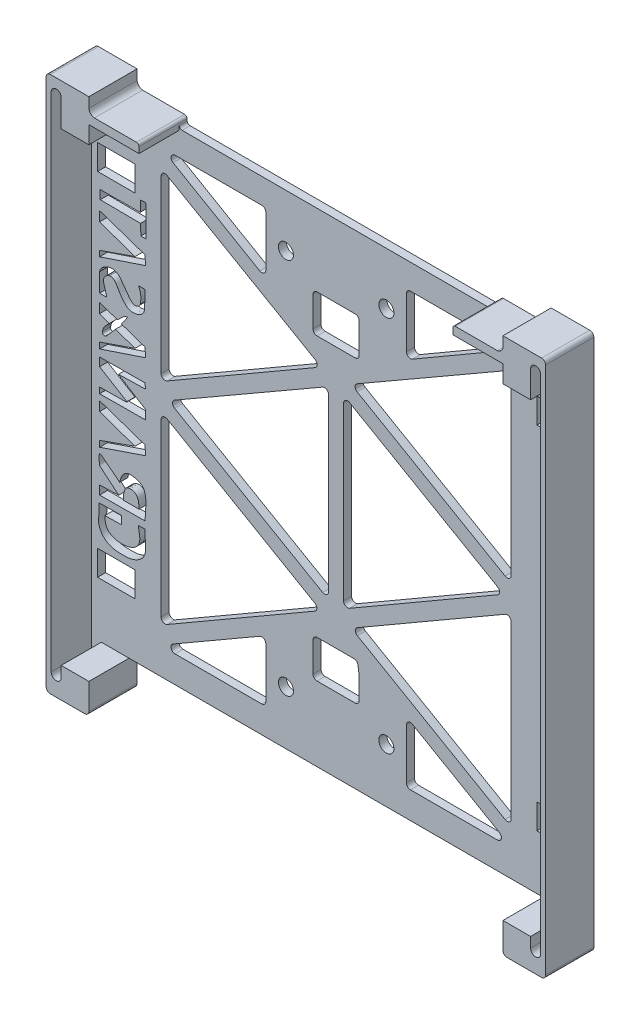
from build123d import *

# Parameters (mm, degrees)
MODEL_W                  = 7.5012
MODEL_H                  = 5.0008
MODEL_R                  = 1.504027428
MODEL_R_2                = 1.502934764
MODEL_R_3                = 1.508781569
MODEL_R_4                = 1.499795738
BOSS_EXTRUDE1_DEPTH      = 1.6
BOSS_EXTRUDE3_DEPTH      = 8
BOSS_EXTRUDE3_DEPTH_BACK = 1.6
CUT_EXTRUDE3_DEPTH       = 1.6


with BuildPart() as part:
    # Model → Boss-Extrude1 (new body)
    with BuildSketch(Plane.XY):
        with BuildLine():
            Line((32.018808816, 162.884149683), (22.042980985, 162.884149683))
            Line((22.042980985, 162.884149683), (22.042980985, 159.412149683))
            Line((22.042980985, 159.412149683), (16.534180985, 159.412149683))
            Line((16.534180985, 159.412149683), (16.534180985, 164.832149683))
            ThreePointArc((16.534180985, 164.832149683), (15.534180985, 165.784563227), (14.534180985, 164.832149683))
            Line((14.534180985, 164.832149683), (14.534180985, 64.720646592))
            ThreePointArc((14.534180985, 64.720646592), (15.608703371, 63.748696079), (16.528746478, 64.867984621))
            Line((16.528746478, 64.867984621), (16.528746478, 66.871184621))
            Line((16.528746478, 66.871184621), (110.000931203, 66.871184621))
            Line((110.000931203, 66.871184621), (110.000931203, 64.867984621))
            ThreePointArc((110.000931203, 64.867984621), (110.927950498, 63.843135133), (111.995496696, 64.720646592))
            Line((111.995496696, 64.720646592), (111.995496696, 164.877016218))
            ThreePointArc((111.995496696, 164.877016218), (110.976206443, 165.784310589), (109.998696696, 164.832149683))
            Line((109.998696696, 164.832149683), (109.998696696, 159.412149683))
            Line((109.998696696, 159.412149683), (104.486696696, 159.412149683))
            Line((104.486696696, 159.412149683), (104.486696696, 162.884149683))
            Line((104.486696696, 162.884149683), (94.510868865, 162.884149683))
            Line((94.510868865, 162.884149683), (94.510868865, 163.684149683))
            ThreePointArc((94.510868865, 163.684149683), (94.364422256, 163.330596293), (94.010868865, 163.184149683))
            Line((94.010868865, 163.184149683), (32.605896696, 163.184149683))
            ThreePointArc((32.605896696, 163.184149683), (32.220321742, 163.326089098), (32.018808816, 163.684149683))
            Line((32.018808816, 163.684149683), (32.018808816, 162.884149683))
        make_face()
        with BuildLine():
            Line((30.788836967, 73.688085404), (48.076150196, 83.6737952))
            ThreePointArc((48.076150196, 83.6737952), (48.876223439, 83.673922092), (49.276296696, 82.981059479))
            Line((49.276296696, 82.981059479), (49.276296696, 72.995349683))
            ThreePointArc((49.276296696, 72.995349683), (49.041982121, 72.429664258), (48.476296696, 72.195349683))
            Line((48.476296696, 72.195349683), (31.188983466, 72.195349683))
            ThreePointArc((31.188983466, 72.195349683), (30.416264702, 72.788212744), (30.788836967, 73.688085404))
        make_face(mode=Mode.SUBTRACT)
        with BuildLine():
            Line((77.273096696, 72.995349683), (77.273096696, 82.996771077))
            ThreePointArc((77.273096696, 82.996771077), (77.673169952, 83.689633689), (78.473243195, 83.689506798))
            Line((78.473243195, 83.689506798), (95.787756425, 73.688085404))
            ThreePointArc((95.787756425, 73.688085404), (96.16032869, 72.788212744), (95.387609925, 72.195349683))
            Line((95.387609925, 72.195349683), (78.073096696, 72.195349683))
            ThreePointArc((78.073096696, 72.195349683), (77.507411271, 72.429664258), (77.273096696, 72.995349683))
        make_face(mode=Mode.SUBTRACT)
        with Locations((107.005580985, 80.199341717)):
            Rectangle(MODEL_W, MODEL_H, mode=Mode.SUBTRACT)
        with Locations((107.005580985, 150.178826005)):
            Rectangle(MODEL_W, MODEL_H, mode=Mode.SUBTRACT)
        with BuildLine():
            Line((95.764394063, 156.697093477), (78.474761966, 146.659393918))
            ThreePointArc((78.474761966, 146.659393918), (77.673930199, 146.657949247), (77.273096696, 147.351250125))
            Line((77.273096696, 147.351250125), (77.273096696, 157.388949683))
            ThreePointArc((77.273096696, 157.388949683), (77.507411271, 157.954635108), (78.073096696, 158.188949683))
            Line((78.073096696, 158.188949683), (95.362728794, 158.188949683))
            ThreePointArc((95.362728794, 158.188949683), (96.135219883, 157.596934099), (95.764394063, 156.697093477))
        make_face(mode=Mode.SUBTRACT)
        with BuildLine():
            Line((49.276296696, 157.388949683), (49.276296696, 147.367041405))
            ThreePointArc((49.276296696, 147.367041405), (48.875463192, 146.673740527), (48.074631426, 146.675185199))
            Line((48.074631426, 146.675185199), (30.812199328, 156.697093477))
            ThreePointArc((30.812199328, 156.697093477), (30.441373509, 157.596934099), (31.213864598, 158.188949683))
            Line((31.213864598, 158.188949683), (48.476296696, 158.188949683))
            ThreePointArc((48.476296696, 158.188949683), (49.041982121, 157.954635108), (49.276296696, 157.388949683))
        make_face(mode=Mode.SUBTRACT)
        with Locations((19.524096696, 150.178826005)):
            Rectangle(MODEL_W, MODEL_H, mode=Mode.SUBTRACT)
        with Locations((19.524096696, 80.199341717)):
            Rectangle(MODEL_W, MODEL_H, mode=Mode.SUBTRACT)
        with BuildLine():
            ThreePointArc((67.453492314, 135.512106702), (67.053600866, 136.205218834), (67.454106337, 136.897976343))
            Line((67.454106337, 136.897976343), (96.929602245, 153.887002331))
            ThreePointArc((96.929602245, 153.887002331), (97.729349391, 153.886564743), (98.129096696, 153.193890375))
            Line((98.129096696, 153.193890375), (98.129096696, 119.181024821))
            ThreePointArc((98.129096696, 119.181024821), (97.729042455, 118.488173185), (96.928988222, 118.488267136))
            Line((96.928988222, 118.488267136), (67.453492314, 135.512106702))
        make_face(mode=Mode.SUBTRACT)
        with BuildLine():
            Line((58.674696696, 141.969749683), (58.674696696, 147.961749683))
            ThreePointArc((58.674696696, 147.961749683), (58.909011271, 148.527435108), (59.474696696, 148.761749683))
            Line((59.474696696, 148.761749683), (67.074696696, 148.761749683))
            ThreePointArc((67.074696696, 148.761749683), (67.640382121, 148.527435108), (67.874696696, 147.961749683))
            Line((67.874696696, 147.961749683), (67.874696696, 141.969749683))
            ThreePointArc((67.874696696, 141.969749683), (67.640382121, 141.404064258), (67.074696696, 141.169749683))
            Line((67.074696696, 141.169749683), (59.474696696, 141.169749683))
            ThreePointArc((59.474696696, 141.169749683), (58.909011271, 141.404064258), (58.674696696, 141.969749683))
        make_face(mode=Mode.SUBTRACT)
        with Locations((73.283162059, 152.758526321)):
            Circle(MODEL_R, mode=Mode.SUBTRACT)
        with Locations((53.281540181, 77.572581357)):
            Circle(MODEL_R_2, mode=Mode.SUBTRACT)
        with BuildLine():
            Line((28.420296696, 77.168371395), (28.420296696, 111.223746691))
            ThreePointArc((28.420296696, 111.223746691), (28.820835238, 111.916877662), (29.621373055, 111.915944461))
            Line((29.621373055, 111.915944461), (59.038631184, 94.870863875))
            ThreePointArc((59.038631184, 94.870863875), (59.437554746, 94.17831181), (59.038017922, 93.486113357))
            Line((59.038017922, 93.486113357), (29.620759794, 76.475818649))
            ThreePointArc((29.620759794, 76.475818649), (28.820528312, 76.4754174), (28.420296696, 77.168371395))
        make_face(mode=Mode.SUBTRACT)
        with Locations((73.277457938, 77.634444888)):
            Circle(MODEL_R_3, mode=Mode.SUBTRACT)
        with BuildLine():
            Line((58.674696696, 82.449749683), (58.674696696, 88.385749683))
            ThreePointArc((58.674696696, 88.385749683), (58.909011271, 88.951435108), (59.474696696, 89.185749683))
            Line((59.474696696, 89.185749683), (66.84072709, 89.185749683))
            ThreePointArc((66.84072709, 89.185749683), (67.367930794, 88.987460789), (67.633787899, 88.490890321))
            Line((67.633787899, 88.490890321), (67.867757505, 86.726091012))
            ThreePointArc((67.867757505, 86.726091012), (67.872960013, 86.673635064), (67.874696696, 86.620950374))
            Line((67.874696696, 86.620950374), (67.874696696, 82.449749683))
            ThreePointArc((67.874696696, 82.449749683), (67.640382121, 81.884064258), (67.074696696, 81.649749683))
            Line((67.074696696, 81.649749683), (59.474696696, 81.649749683))
            ThreePointArc((59.474696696, 81.649749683), (58.909011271, 81.884064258), (58.674696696, 82.449749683))
        make_face(mode=Mode.SUBTRACT)
        with BuildLine():
            Line((96.928988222, 76.493067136), (67.507163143, 93.485908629))
            ThreePointArc((67.507163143, 93.485908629), (67.107271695, 94.178312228), (67.506550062, 94.871069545))
            Line((67.506550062, 94.871069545), (96.928375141, 111.898661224))
            ThreePointArc((96.928375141, 111.898661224), (97.728735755, 111.899286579), (98.129096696, 111.206257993))
            Line((98.129096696, 111.206257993), (98.129096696, 77.185824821))
            ThreePointArc((98.129096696, 77.185824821), (97.729042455, 76.492973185), (96.928988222, 76.493067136))
        make_face(mode=Mode.SUBTRACT)
        with BuildLine():
            Line((60.57862231, 97.492537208), (31.103193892, 114.514403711))
            ThreePointArc((31.103193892, 114.514403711), (30.703268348, 115.207515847), (31.103773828, 115.900293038))
            Line((31.103773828, 115.900293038), (60.579202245, 132.889280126))
            ThreePointArc((60.579202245, 132.889280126), (61.378949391, 132.888842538), (61.778696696, 132.19616817))
            Line((61.778696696, 132.19616817), (61.778696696, 98.185314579))
            ThreePointArc((61.778696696, 98.185314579), (61.378659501, 97.492472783), (60.57862231, 97.492537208))
        make_face(mode=Mode.SUBTRACT)
        with BuildLine():
            Line((59.091626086, 135.512311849), (29.620759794, 118.471018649))
            ThreePointArc((29.620759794, 118.471018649), (28.820528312, 118.4706174), (28.420296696, 119.163571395))
            Line((28.420296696, 119.163571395), (28.420296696, 153.211308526))
            ThreePointArc((28.420296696, 153.211308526), (28.82022115, 153.904085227), (29.620145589, 153.904216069))
            Line((29.620145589, 153.904216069), (59.091011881, 136.897772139))
            ThreePointArc((59.091011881, 136.897772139), (59.491162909, 136.205219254), (59.091626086, 135.512311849))
        make_face(mode=Mode.SUBTRACT)
        with Locations((53.273086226, 152.740653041)):
            Circle(MODEL_R_4, mode=Mode.SUBTRACT)
        with BuildLine():
            Line((95.421279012, 114.495082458), (65.95174538, 97.437445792))
            ThreePointArc((65.95174538, 97.437445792), (65.151363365, 97.43678328), (64.750980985, 98.129824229))
            Line((64.750980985, 98.129824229), (64.750980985, 132.212149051))
            ThreePointArc((64.750980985, 132.212149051), (65.151073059, 132.905022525), (65.951165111, 132.904863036))
            Line((65.951165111, 132.904863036), (95.420698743, 115.880174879))
            ThreePointArc((95.420698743, 115.880174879), (95.820514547, 115.187796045), (95.421279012, 114.495082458))
        make_face(mode=Mode.SUBTRACT)
    extrude(amount=-BOSS_EXTRUDE1_DEPTH)

    # Model_5 → Boss-Extrude3 (add, two sides: drawn at the far end of the back side and taken through both)
    with BuildSketch(Plane.XY.offset(-BOSS_EXTRUDE3_DEPTH_BACK)):
        with BuildLine():
            Line((22.042980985, 159.412149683), (22.042980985, 162.884149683))
            Line((22.042980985, 162.884149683), (32.018808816, 162.884149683))
            Line((32.018808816, 162.884149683), (32.018808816, 164.087349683))
            ThreePointArc((32.018808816, 164.087349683), (31.872362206, 164.440903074), (31.518808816, 164.587349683))
            Line((31.518808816, 164.587349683), (23.139780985, 164.587349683))
            ThreePointArc((23.139780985, 164.587349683), (22.40350278, 164.951071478), (22.039780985, 165.687349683))
            Line((22.039780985, 165.687349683), (22.039780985, 167.703349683))
            Line((22.039780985, 167.703349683), (14.345380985, 167.703349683))
            ThreePointArc((14.345380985, 167.703349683), (13.77969556, 167.469035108), (13.545380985, 166.903349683))
            Line((13.545380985, 166.903349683), (13.545380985, 61.688949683))
            ThreePointArc((13.545380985, 61.688949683), (13.77969556, 61.123264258), (14.345380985, 60.888949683))
            Line((14.345380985, 60.888949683), (21.239780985, 60.888949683))
            ThreePointArc((21.239780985, 60.888949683), (21.80546641, 61.123264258), (22.039780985, 61.688949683))
            Line((22.039780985, 61.688949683), (22.039780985, 66.871184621))
            Line((22.039780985, 66.871184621), (16.528746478, 66.871184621))
            Line((16.528746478, 66.871184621), (16.528746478, 64.867984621))
            ThreePointArc((16.528746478, 64.867984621), (15.608703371, 63.748696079), (14.534180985, 64.720646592))
            Line((14.534180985, 64.720646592), (14.534180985, 164.832149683))
            ThreePointArc((14.534180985, 164.832149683), (15.534180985, 165.784563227), (16.534180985, 164.832149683))
            Line((16.534180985, 164.832149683), (16.534180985, 159.412149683))
            Line((16.534180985, 159.412149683), (22.042980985, 159.412149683))
        make_face()
        with BuildLine():
            Line((94.510868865, 164.087349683), (94.510868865, 162.884149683))
            Line((94.510868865, 162.884149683), (104.486696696, 162.884149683))
            Line((104.486696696, 162.884149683), (104.486696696, 159.412149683))
            Line((104.486696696, 159.412149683), (109.998696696, 159.412149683))
            Line((109.998696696, 159.412149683), (109.998696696, 164.832149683))
            ThreePointArc((109.998696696, 164.832149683), (110.976206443, 165.784310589), (111.995496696, 164.877016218))
            Line((111.995496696, 164.877016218), (111.995496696, 64.720646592))
            ThreePointArc((111.995496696, 64.720646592), (110.927950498, 63.843135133), (110.000931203, 64.867984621))
            Line((110.000931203, 64.867984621), (110.000931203, 66.871184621))
            Line((110.000931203, 66.871184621), (104.489896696, 66.871184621))
            Line((104.489896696, 66.871184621), (104.489896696, 61.688949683))
            ThreePointArc((104.489896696, 61.688949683), (104.724211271, 61.123264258), (105.289896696, 60.888949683))
            Line((105.289896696, 60.888949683), (112.184296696, 60.888949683))
            ThreePointArc((112.184296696, 60.888949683), (112.749982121, 61.123264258), (112.984296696, 61.688949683))
            Line((112.984296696, 61.688949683), (112.984296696, 166.903349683))
            ThreePointArc((112.984296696, 166.903349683), (112.749982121, 167.469035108), (112.184296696, 167.703349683))
            Line((112.184296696, 167.703349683), (104.489896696, 167.703349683))
            Line((104.489896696, 167.703349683), (104.489896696, 165.687349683))
            ThreePointArc((104.489896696, 165.687349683), (104.126174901, 164.951071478), (103.389896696, 164.587349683))
            Line((103.389896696, 164.587349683), (95.010868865, 164.587349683))
            ThreePointArc((95.010868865, 164.587349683), (94.657315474, 164.440903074), (94.510868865, 164.087349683))
        make_face()
    extrude(amount=BOSS_EXTRUDE3_DEPTH + BOSS_EXTRUDE3_DEPTH_BACK)

    # Sketch1 → Cut-Extrude3 (cut)
    # profile 1 of 8: a face of its own
    with BuildSketch(Plane(origin=(0, 0, -1.6), x_dir=(-1, 0, 0), z_dir=(0, 0, -1))):
        with BuildLine():
            Line((-25.236090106, 90.745665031), (-23.876684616, 90.680931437))
            add(Edge.make_bspline(
                [(-23.876684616, 90.680931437), (-23.981001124, 89.637766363), (-24.421190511, 88.611315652), (-24.006151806, 87.57371889), (-23.151602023, 85.437344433), (-18.661519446, 85.302867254), (-17.597525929, 87.185317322), (-17.283095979, 87.741616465), (-17.288383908, 88.42851519), (-17.209124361, 89.062591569)],
                knots=[0, 0, 0, 0, 1, 1, 1, 2, 2, 2, 3, 3, 3, 3], degree=3))
            Line((-17.209124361, 89.062591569), (-20.575271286, 89.127325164))
            Line((-20.575271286, 89.127325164), (-20.510537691, 90.745665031))
            Line((-20.510537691, 90.745665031), (-16.108653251, 90.680931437))
            add(Edge.make_bspline(
                [(-16.108653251, 90.680931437), (-16.152581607, 87.825588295), (-15.555953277, 87.395660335), (-16.561788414, 85.761178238), (-17.224724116, 84.683907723), (-18.614305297, 84.134493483), (-19.798468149, 84.078104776), (-21.734199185, 83.985927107), (-23.4724967, 84.038109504), (-24.782954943, 85.566977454), (-25.054265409, 85.883506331), (-25.290871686, 86.573086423), (-25.3008237, 86.926382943), (-25.336676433, 88.199154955), (-25.25766797, 89.472571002), (-25.236090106, 90.745665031)],
                knots=[0, 0, 0, 0, 1, 1, 1, 2, 2, 2, 3, 3, 3, 4, 4, 4, 5, 5, 5, 5], degree=3))
        make_face()
    # profile 2 of 8: a face of its own
    with BuildSketch(Plane(origin=(0, 0, -1.6), x_dir=(-1, 0, 0), z_dir=(0, 0, -1))):
        with BuildLine():
            Line((-20.186869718, 96.277016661), (-16.36758763, 99.254762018))
            Line((-16.36758763, 99.254762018), (-16.108653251, 99.190028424))
            add(Edge.make_bspline(
                [(-16.108653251, 99.190028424), (-16.130231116, 98.521114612), (-16.045645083, 97.840244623), (-16.173386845, 97.183286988), (-16.200794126, 97.042335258), (-19.589793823, 94.349482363), (-19.992668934, 93.946607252)],
                knots=[0, 0, 0, 0, 1, 1, 1, 2, 2, 2, 2], degree=3))
            Line((-19.992668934, 93.946607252), (-16.108653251, 93.817140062))
            Line((-16.108653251, 93.817140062), (-16.173386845, 92.069333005))
            Line((-16.173386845, 92.069333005), (-25.236090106, 92.1340666))
            add(Edge.make_bspline(
                [(-25.236090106, 92.1340666), (-25.212772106, 93.88291657), (-25.730856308, 95.769898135), (-25.041889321, 97.377487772), (-24.837695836, 97.853939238), (-24.343681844, 98.176440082), (-23.876684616, 98.348491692), (-21.798075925, 99.114294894), (-20.628793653, 98.486636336), (-20.186869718, 96.277016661)],
                knots=[0, 0, 0, 0, 1, 1, 1, 2, 2, 2, 3, 3, 3, 3], degree=3))
        make_face()
        with BuildLine():
            Line((-24.029860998, 93.558205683), (-20.901573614, 93.558205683))
            add(Edge.make_bspline(
                [(-20.901573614, 93.558205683), (-20.93188908, 94.176304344), (-20.923131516, 94.785266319), (-21.160478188, 95.361107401), (-21.219315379, 95.503855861), (-21.222431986, 95.675523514), (-21.318221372, 95.796615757), (-21.414010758, 95.917708), (-21.56840916, 95.979776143), (-21.705720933, 96.050376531), (-22.452165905, 96.434169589), (-23.439594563, 96.088135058), (-23.774385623, 95.301096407), (-23.843294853, 95.139102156), (-23.911741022, 94.972898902), (-23.937272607, 94.798718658), (-23.997410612, 94.388448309), (-23.998998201, 93.971710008), (-24.029860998, 93.558205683)],
                knots=[0, 0, 0, 0, 1, 1, 1, 2, 2, 2, 3, 3, 3, 4, 4, 4, 5, 5, 5, 6, 6, 6, 6], degree=3))
        make_face(mode=Mode.SUBTRACT)
    # profile 3 of 8: a face of its own
    with BuildSketch(Plane(origin=(0, 0, -1.6), x_dir=(-1, 0, 0), z_dir=(0, 0, -1))):
        Polygon((-24.32981978, 147.014672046), (-25.365557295, 147.079405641), (-25.43029089, 140.864980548), (-24.394553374, 140.864980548), (-24.32981978, 143.001189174), (-16.302854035, 143.065922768), (-16.23812044, 144.813729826), (-24.265086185, 144.87846342), align=None)
    # profile 4 of 8: a face of its own
    with BuildSketch(Plane(origin=(0, 0, -1.6), x_dir=(-1, 0, 0), z_dir=(0, 0, -1))):
        Polygon((-25.236090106, 115.949288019), (-25.3008237, 114.913550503), (-19.927935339, 114.784083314), (-25.3008237, 111.417936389), (-25.365557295, 109.605395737), (-16.173386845, 109.540662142), (-16.108653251, 110.705866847), (-21.546275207, 110.770600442), (-21.611008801, 110.900067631), (-16.173386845, 114.201480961), (-16.108653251, 115.884554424), align=None)
    # profile 5 of 8: a face of its own
    with BuildSketch(Plane(origin=(0, 0, -1.6), x_dir=(-1, 0, 0), z_dir=(0, 0, -1))):
        Polygon((-25.3008237, 103.426708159), (-25.236090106, 105.239248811), (-16.173386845, 108.346461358), (-16.173386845, 106.469187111), (-23.229348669, 104.009310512), (-16.108653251, 101.484700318), (-16.173386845, 100.319495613), align=None)
    # profile 6 of 8: a face of its own
    with BuildSketch(Plane(origin=(0, 0, -1.6), x_dir=(-1, 0, 0), z_dir=(0, 0, -1))):
        with BuildLine():
            Line((-25.3008237, 120.315434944), (-25.236090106, 122.127975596))
            Line((-25.236090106, 122.127975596), (-20.510537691, 123.746315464))
            Line((-20.510537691, 123.746315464), (-21.740475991, 125.494122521))
            add(Edge.make_bspline(
                [(-21.740475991, 125.494122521), (-21.567853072, 125.472544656), (-21.37820743, 125.507189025), (-21.222607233, 125.429388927), (-20.947446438, 125.291808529), (-20.060772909, 124.350302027), (-19.733734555, 124.069983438)],
                knots=[0, 0, 0, 0, 1, 1, 1, 2, 2, 2, 2], degree=3))
            Line((-19.733734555, 124.069983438), (-16.173386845, 125.299921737))
            Line((-16.173386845, 125.299921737), (-16.173386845, 123.357913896))
            Line((-16.173386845, 123.357913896), (-18.115394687, 122.645844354))
            add(Edge.make_bspline(
                [(-18.115394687, 122.645844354), (-17.366864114, 121.850530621), (-16.922436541, 121.573053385), (-16.755989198, 120.574369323)],
                knots=[0, 0, 0, 0, 1, 1, 1, 1], degree=3))
            add(Edge.make_bspline(
                [(-17.597525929, 120.250701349), (-17.399924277, 120.093539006), (-17.33227537, 120.013982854), (-16.951854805, 120.04814731), (-16.778904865, 120.147334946), (-16.727497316, 120.388176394), (-16.755989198, 120.574369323)],
                knots=[0, 0, 0, 0, 0.197976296, 0.260773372, 0.627970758, 1, 1, 1, 1], degree=3))
            Line((-17.597525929, 120.250701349), (-19.345332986, 122.257442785))
            Line((-19.345332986, 122.257442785), (-23.229348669, 120.898037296))
            Line((-23.229348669, 120.898037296), (-16.108653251, 118.438160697))
            Line((-16.108653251, 118.438160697), (-16.173386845, 117.272955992))
            Line((-16.173386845, 117.272955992), (-25.3008237, 120.315434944))
        make_face()
    # profile 7 of 8: a face of its own
    with BuildSketch(Plane(origin=(0, 0, -1.6), x_dir=(-1, 0, 0), z_dir=(0, 0, -1))):
        Polygon((-25.3008237, 136.204161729), (-25.236090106, 138.016702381), (-16.173386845, 141.123914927), (-16.173386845, 139.181907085), (-23.229348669, 136.722030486), (-16.108653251, 134.262153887), (-16.173386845, 133.161682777), align=None)
    # profile 8 of 8: a face of its own
    with BuildSketch(Plane(origin=(0, 0, -1.6), x_dir=(-1, 0, 0), z_dir=(0, 0, -1))):
        with BuildLine():
            Line((-25.137875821, 128.644091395), (-25.236090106, 132.052792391))
            Line((-25.236090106, 132.052792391), (-23.876684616, 132.052792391))
            add(Edge.make_bspline(
                [(-24.32981978, 129.090681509), (-24.447574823, 130.085166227), (-24.466275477, 131.177949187), (-23.876684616, 132.052792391)],
                knots=[0, 0, 0, 0, 1, 1, 1, 1], degree=3))
            add(Edge.make_bspline(
                [(-16.173386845, 130.596779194), (-16.338259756, 131.476546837), (-17.335512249, 132.13579608), (-18.762471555, 132.482634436), (-20.065509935, 132.046736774), (-20.818057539, 130.826434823), (-21.77643535, 129.602717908), (-22.345073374, 128.622863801), (-23.523055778, 128.090259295), (-24.152876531, 128.700021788), (-24.32981978, 129.090681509)],
                knots=[0, 0, 0, 0, 0.22922623, 0.291068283, 0.398624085, 0.57520612, 0.666870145, 0.827893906, 0.872218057, 1, 1, 1, 1], degree=3))
            Line((-16.173386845, 130.596779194), (-16.173386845, 126.891607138))
            Line((-16.173386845, 126.891607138), (-17.597525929, 126.891607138))
            add(Edge.make_bspline(
                [(-25.137875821, 128.644091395), (-25.107652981, 127.628654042), (-23.687090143, 126.68344585), (-21.86006139, 126.941845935), (-20.814434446, 128.015667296), (-19.939858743, 129.240548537), (-19.312700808, 130.56062111), (-18.405701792, 130.964354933), (-17.517200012, 130.742950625), (-16.833278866, 129.819237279), (-17.118580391, 128.418706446), (-17.474987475, 127.614349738), (-17.597525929, 126.891607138)],
                knots=[0, 0, 0, 0, 0.19461844, 0.30114898, 0.361586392, 0.503456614, 0.62754751, 0.645686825, 0.709197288, 0.80268906, 0.854773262, 1, 1, 1, 1], degree=3))
        make_face()
    extrude(amount=-CUT_EXTRUDE3_DEPTH, mode=Mode.SUBTRACT)


with BuildPart() as cut_extrude3_piece_1:
    # of the separate pieces the step leaves, piece 1, a body of its own (cut_extrude3_pieces)
    add(part.part.solids().sort_by_distance((94.510868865, 163.684149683, 0))[0])


with BuildPart() as cut_extrude3_piece_2:
    # of the separate pieces the step leaves, piece 2, a body of its own (cut_extrude3_pieces)
    add(part.part.solids().sort_by_distance((24.029860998, 93.558205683, 0))[0])


solid = Compound([cut_extrude3_piece_1.part, cut_extrude3_piece_2.part])
